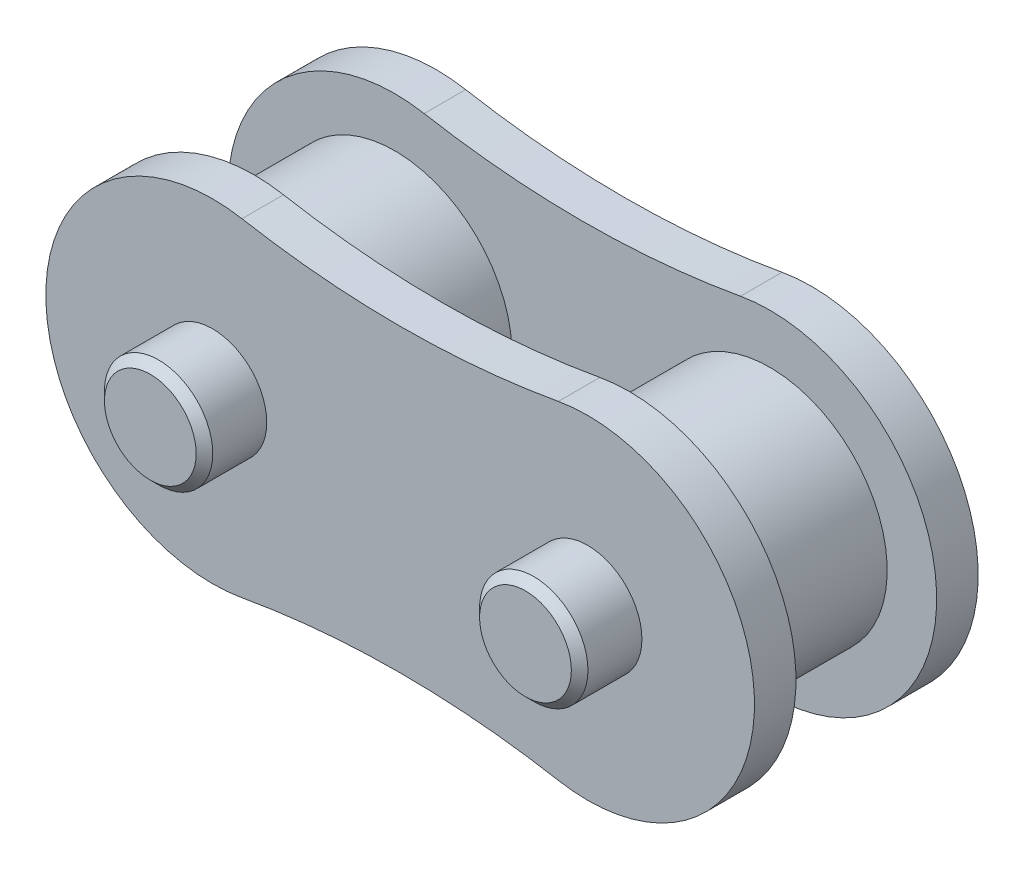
ISO-10303-21;
HEADER;
FILE_DESCRIPTION(('STEP AP214'),'2;1');
FILE_NAME('part.step','',(''),(''),'','','');
FILE_SCHEMA(('AUTOMOTIVE_DESIGN { 1 0 10303 214 1 1 1 1 }'));
ENDSEC;
DATA;
#1=APPLICATION_CONTEXT('core data for automotive mechanical design processes');
#2=APPLICATION_PROTOCOL_DEFINITION('international standard','automotive_design',2000,#1);
#3=PRODUCT_CONTEXT('',#1,'mechanical');
#4=PRODUCT('Part','Part','',(#3));
#5=PRODUCT_RELATED_PRODUCT_CATEGORY('part','',(#4));
#6=PRODUCT_DEFINITION_FORMATION('','',#4);
#7=PRODUCT_DEFINITION_CONTEXT('part definition',#1,'design');
#8=PRODUCT_DEFINITION('design','',#6,#7);
#9=PRODUCT_DEFINITION_SHAPE('','',#8);
#10=(LENGTH_UNIT() NAMED_UNIT(*) SI_UNIT(.MILLI.,.METRE.));
#11=(NAMED_UNIT(*) PLANE_ANGLE_UNIT() SI_UNIT($,.RADIAN.));
#12=(NAMED_UNIT(*) SI_UNIT($,.STERADIAN.) SOLID_ANGLE_UNIT());
#13=UNCERTAINTY_MEASURE_WITH_UNIT(LENGTH_MEASURE(1.E-05),#10,'distance_accuracy_value','');
#14=(GEOMETRIC_REPRESENTATION_CONTEXT(3) GLOBAL_UNCERTAINTY_ASSIGNED_CONTEXT((#13)) GLOBAL_UNIT_ASSIGNED_CONTEXT((#10,
#11,#12)) REPRESENTATION_CONTEXT('',''));
#15=CARTESIAN_POINT('',(0.,0.,0.));
#16=DIRECTION('',(0.,0.,1.));
#17=DIRECTION('',(1.,0.,0.));
#18=AXIS2_PLACEMENT_3D('',#15,#16,#17);
#19=CARTESIAN_POINT('',(-2.,-11.1628830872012,2.385));
#20=DIRECTION('',(0.,0.,1.));
#21=DIRECTION('',(1.,0.,0.));
#22=AXIS2_PLACEMENT_3D('',#19,#20,#21);
#23=PLANE('',#22);
#24=CARTESIAN_POINT('',(4.,0.,2.385));
#25=DIRECTION('',(0.,0.,1.));
#26=DIRECTION('',(1.,0.,0.));
#27=AXIS2_PLACEMENT_3D('',#24,#25,#26);
#28=CIRCLE('',#27,1.155);
#29=CARTESIAN_POINT('',(5.155,0.,2.385));
#30=VERTEX_POINT('',#29);
#31=EDGE_CURVE('E158',#30,#30,#28,.T.);
#32=ORIENTED_EDGE('',*,*,#31,.F.);
#33=EDGE_LOOP('',(#32));
#34=FACE_BOUND('',#33,.T.);
#35=CARTESIAN_POINT('',(0.,-22.3257661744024,2.385));
#36=DIRECTION('',(0.,0.,-1.));
#37=DIRECTION('',(1.,0.,0.));
#38=AXIS2_PLACEMENT_3D('',#35,#36,#37);
#39=CIRCLE('',#38,19.1262661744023);
#40=CARTESIAN_POINT('',(-3.37305087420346,-3.49927989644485,2.385));
#41=VERTEX_POINT('',#40);
#42=CARTESIAN_POINT('',(3.37305087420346,-3.49927989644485,2.385));
#43=VERTEX_POINT('',#42);
#44=EDGE_CURVE('E162',#41,#43,#39,.T.);
#45=ORIENTED_EDGE('',*,*,#44,.T.);
#46=CARTESIAN_POINT('',(4.,0.,2.385));
#47=DIRECTION('',(0.,0.,1.));
#48=DIRECTION('',(1.,0.,0.));
#49=AXIS2_PLACEMENT_3D('',#46,#47,#48);
#50=CIRCLE('',#49,3.55500000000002);
#51=CARTESIAN_POINT('',(3.37305087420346,3.49927989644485,2.385));
#52=VERTEX_POINT('',#51);
#53=EDGE_CURVE('E80',#43,#52,#50,.T.);
#54=ORIENTED_EDGE('',*,*,#53,.T.);
#55=CARTESIAN_POINT('',(0.,22.3257661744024,2.385));
#56=DIRECTION('',(0.,0.,-1.));
#57=DIRECTION('',(1.,0.,0.));
#58=AXIS2_PLACEMENT_3D('',#55,#56,#57);
#59=CIRCLE('',#58,19.1262661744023);
#60=CARTESIAN_POINT('',(-3.37305087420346,3.49927989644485,2.385));
#61=VERTEX_POINT('',#60);
#62=EDGE_CURVE('E165',#52,#61,#59,.T.);
#63=ORIENTED_EDGE('',*,*,#62,.T.);
#64=CARTESIAN_POINT('',(-4.,0.,2.385));
#65=DIRECTION('',(0.,0.,1.));
#66=DIRECTION('',(1.,0.,0.));
#67=AXIS2_PLACEMENT_3D('',#64,#65,#66);
#68=CIRCLE('',#67,3.55500000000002);
#69=EDGE_CURVE('E48',#61,#41,#68,.T.);
#70=ORIENTED_EDGE('',*,*,#69,.T.);
#71=EDGE_LOOP('',(#45,#54,#63,#70));
#72=FACE_BOUND('',#71,.T.);
#73=CARTESIAN_POINT('',(-4.,0.,2.385));
#74=DIRECTION('',(0.,0.,1.));
#75=DIRECTION('',(1.,0.,0.));
#76=AXIS2_PLACEMENT_3D('',#73,#74,#75);
#77=CIRCLE('',#76,1.155);
#78=CARTESIAN_POINT('',(-2.845,0.,2.385));
#79=VERTEX_POINT('',#78);
#80=EDGE_CURVE('E155',#79,#79,#77,.T.);
#81=ORIENTED_EDGE('',*,*,#80,.F.);
#82=EDGE_LOOP('',(#81));
#83=FACE_BOUND('',#82,.T.);
#84=ADVANCED_FACE('F31',(#34,#72,#83),#23,.T.);
#85=CARTESIAN_POINT('',(-2.,-11.1628830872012,1.5));
#86=DIRECTION('',(0.,0.,1.));
#87=DIRECTION('',(1.,0.,0.));
#88=AXIS2_PLACEMENT_3D('',#85,#86,#87);
#89=PLANE('',#88);
#90=CARTESIAN_POINT('',(4.,0.,1.5));
#91=DIRECTION('',(0.,0.,1.));
#92=DIRECTION('',(1.,0.,0.));
#93=AXIS2_PLACEMENT_3D('',#90,#91,#92);
#94=CIRCLE('',#93,2.5);
#95=CARTESIAN_POINT('',(6.5,0.,1.5));
#96=VERTEX_POINT('',#95);
#97=EDGE_CURVE('E182',#96,#96,#94,.T.);
#98=ORIENTED_EDGE('',*,*,#97,.T.);
#99=EDGE_LOOP('',(#98));
#100=FACE_BOUND('',#99,.T.);
#101=CARTESIAN_POINT('',(0.,-22.3257661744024,1.5));
#102=DIRECTION('',(0.,0.,-1.));
#103=DIRECTION('',(1.,0.,0.));
#104=AXIS2_PLACEMENT_3D('',#101,#102,#103);
#105=CIRCLE('',#104,19.1262661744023);
#106=CARTESIAN_POINT('',(-3.37305087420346,-3.49927989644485,1.5));
#107=VERTEX_POINT('',#106);
#108=CARTESIAN_POINT('',(3.37305087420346,-3.49927989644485,1.5));
#109=VERTEX_POINT('',#108);
#110=EDGE_CURVE('E161',#107,#109,#105,.T.);
#111=ORIENTED_EDGE('',*,*,#110,.F.);
#112=CARTESIAN_POINT('',(-4.,0.,1.5));
#113=DIRECTION('',(0.,0.,1.));
#114=DIRECTION('',(1.,0.,0.));
#115=AXIS2_PLACEMENT_3D('',#112,#113,#114);
#116=CIRCLE('',#115,3.55500000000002);
#117=CARTESIAN_POINT('',(-3.37305087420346,3.49927989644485,1.5));
#118=VERTEX_POINT('',#117);
#119=EDGE_CURVE('E72',#118,#107,#116,.T.);
#120=ORIENTED_EDGE('',*,*,#119,.F.);
#121=CARTESIAN_POINT('',(0.,22.3257661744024,1.5));
#122=DIRECTION('',(0.,0.,-1.));
#123=DIRECTION('',(1.,0.,0.));
#124=AXIS2_PLACEMENT_3D('',#121,#122,#123);
#125=CIRCLE('',#124,19.1262661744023);
#126=CARTESIAN_POINT('',(3.37305087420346,3.49927989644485,1.5));
#127=VERTEX_POINT('',#126);
#128=EDGE_CURVE('E66',#127,#118,#125,.T.);
#129=ORIENTED_EDGE('',*,*,#128,.F.);
#130=CARTESIAN_POINT('',(4.,0.,1.5));
#131=DIRECTION('',(0.,0.,1.));
#132=DIRECTION('',(1.,0.,0.));
#133=AXIS2_PLACEMENT_3D('',#130,#131,#132);
#134=CIRCLE('',#133,3.55500000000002);
#135=EDGE_CURVE('E171',#109,#127,#134,.T.);
#136=ORIENTED_EDGE('',*,*,#135,.F.);
#137=EDGE_LOOP('',(#111,#120,#129,#136));
#138=FACE_BOUND('',#137,.T.);
#139=CARTESIAN_POINT('',(-4.,0.,1.5));
#140=DIRECTION('',(0.,0.,1.));
#141=DIRECTION('',(1.,0.,0.));
#142=AXIS2_PLACEMENT_3D('',#139,#140,#141);
#143=CIRCLE('',#142,2.5);
#144=CARTESIAN_POINT('',(-1.5,0.,1.5));
#145=VERTEX_POINT('',#144);
#146=EDGE_CURVE('E185',#145,#145,#143,.F.);
#147=ORIENTED_EDGE('',*,*,#146,.F.);
#148=EDGE_LOOP('',(#147));
#149=FACE_BOUND('',#148,.T.);
#150=ADVANCED_FACE('F227',(#100,#138,#149),#89,.F.);
#151=CARTESIAN_POINT('',(4.,0.,1.5));
#152=DIRECTION('',(0.,0.,-1.));
#153=DIRECTION('',(-1.,0.,0.));
#154=AXIS2_PLACEMENT_3D('',#151,#152,#153);
#155=CYLINDRICAL_SURFACE('',#154,2.5);
#156=ORIENTED_EDGE('',*,*,#97,.F.);
#157=EDGE_LOOP('',(#156));
#158=FACE_BOUND('',#157,.T.);
#159=CARTESIAN_POINT('',(4.,0.,-1.5));
#160=DIRECTION('',(0.,0.,-1.));
#161=DIRECTION('',(-1.,0.,0.));
#162=AXIS2_PLACEMENT_3D('',#159,#160,#161);
#163=CIRCLE('',#162,2.5);
#164=CARTESIAN_POINT('',(1.5,0.,-1.5));
#165=VERTEX_POINT('',#164);
#166=EDGE_CURVE('E152',#165,#165,#163,.T.);
#167=ORIENTED_EDGE('',*,*,#166,.F.);
#168=EDGE_LOOP('',(#167));
#169=FACE_BOUND('',#168,.T.);
#170=ADVANCED_FACE('F233',(#158,#169),#155,.T.);
#171=CARTESIAN_POINT('',(0.,-22.3257661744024,2.385));
#172=DIRECTION('',(0.,0.,-1.));
#173=DIRECTION('',(-1.,0.,0.));
#174=AXIS2_PLACEMENT_3D('',#171,#172,#173);
#175=CYLINDRICAL_SURFACE('',#174,19.1262661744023);
#176=ORIENTED_EDGE('',*,*,#110,.T.);
#177=DIRECTION('',(0.,0.,-1.));
#178=VECTOR('',#177,1.);
#179=CARTESIAN_POINT('',(3.37305087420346,-3.49927989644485,2.385));
#180=LINE('',#179,#178);
#181=EDGE_CURVE('E180',#43,#109,#180,.T.);
#182=ORIENTED_EDGE('',*,*,#181,.F.);
#183=ORIENTED_EDGE('',*,*,#44,.F.);
#184=DIRECTION('',(0.,0.,-1.));
#185=VECTOR('',#184,1.);
#186=CARTESIAN_POINT('',(-3.37305087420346,-3.49927989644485,2.385));
#187=LINE('',#186,#185);
#188=EDGE_CURVE('E168',#41,#107,#187,.T.);
#189=ORIENTED_EDGE('',*,*,#188,.T.);
#190=EDGE_LOOP('',(#176,#182,#183,#189));
#191=FACE_BOUND('',#190,.T.);
#192=ADVANCED_FACE('F250',(#191),#175,.F.);
#193=CARTESIAN_POINT('',(4.,0.,2.385));
#194=DIRECTION('',(0.,0.,-1.));
#195=DIRECTION('',(-1.,0.,0.));
#196=AXIS2_PLACEMENT_3D('',#193,#194,#195);
#197=CYLINDRICAL_SURFACE('',#196,3.55500000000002);
#198=ORIENTED_EDGE('',*,*,#135,.T.);
#199=DIRECTION('',(0.,0.,-1.));
#200=VECTOR('',#199,1.);
#201=CARTESIAN_POINT('',(3.37305087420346,3.49927989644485,2.385));
#202=LINE('',#201,#200);
#203=EDGE_CURVE('E178',#52,#127,#202,.T.);
#204=ORIENTED_EDGE('',*,*,#203,.F.);
#205=ORIENTED_EDGE('',*,*,#53,.F.);
#206=ORIENTED_EDGE('',*,*,#181,.T.);
#207=EDGE_LOOP('',(#198,#204,#205,#206));
#208=FACE_BOUND('',#207,.T.);
#209=ADVANCED_FACE('F247',(#208),#197,.T.);
#210=CARTESIAN_POINT('',(0.,22.3257661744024,2.385));
#211=DIRECTION('',(0.,0.,-1.));
#212=DIRECTION('',(-1.,0.,0.));
#213=AXIS2_PLACEMENT_3D('',#210,#211,#212);
#214=CYLINDRICAL_SURFACE('',#213,19.1262661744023);
#215=ORIENTED_EDGE('',*,*,#128,.T.);
#216=DIRECTION('',(0.,0.,-1.));
#217=VECTOR('',#216,1.);
#218=CARTESIAN_POINT('',(-3.37305087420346,3.49927989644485,2.385));
#219=LINE('',#218,#217);
#220=EDGE_CURVE('E176',#61,#118,#219,.T.);
#221=ORIENTED_EDGE('',*,*,#220,.F.);
#222=ORIENTED_EDGE('',*,*,#62,.F.);
#223=ORIENTED_EDGE('',*,*,#203,.T.);
#224=EDGE_LOOP('',(#215,#221,#222,#223));
#225=FACE_BOUND('',#224,.T.);
#226=ADVANCED_FACE('F244',(#225),#214,.F.);
#227=CARTESIAN_POINT('',(-4.,0.,2.385));
#228=DIRECTION('',(0.,0.,-1.));
#229=DIRECTION('',(-1.,0.,0.));
#230=AXIS2_PLACEMENT_3D('',#227,#228,#229);
#231=CYLINDRICAL_SURFACE('',#230,3.55500000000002);
#232=ORIENTED_EDGE('',*,*,#119,.T.);
#233=ORIENTED_EDGE('',*,*,#188,.F.);
#234=ORIENTED_EDGE('',*,*,#69,.F.);
#235=ORIENTED_EDGE('',*,*,#220,.T.);
#236=EDGE_LOOP('',(#232,#233,#234,#235));
#237=FACE_BOUND('',#236,.T.);
#238=ADVANCED_FACE('F241',(#237),#231,.T.);
#239=CARTESIAN_POINT('',(-4.,0.,1.5));
#240=DIRECTION('',(0.,0.,-1.));
#241=DIRECTION('',(-1.,0.,0.));
#242=AXIS2_PLACEMENT_3D('',#239,#240,#241);
#243=CYLINDRICAL_SURFACE('',#242,2.5);
#244=ORIENTED_EDGE('',*,*,#146,.T.);
#245=EDGE_LOOP('',(#244));
#246=FACE_BOUND('',#245,.T.);
#247=CARTESIAN_POINT('',(-4.,0.,-1.5));
#248=DIRECTION('',(0.,0.,-1.));
#249=DIRECTION('',(-1.,0.,0.));
#250=AXIS2_PLACEMENT_3D('',#247,#248,#249);
#251=CIRCLE('',#250,2.5);
#252=CARTESIAN_POINT('',(-6.5,0.,-1.5));
#253=VERTEX_POINT('',#252);
#254=EDGE_CURVE('E118',#253,#253,#251,.T.);
#255=ORIENTED_EDGE('',*,*,#254,.F.);
#256=EDGE_LOOP('',(#255));
#257=FACE_BOUND('',#256,.T.);
#258=ADVANCED_FACE('F238',(#246,#257),#243,.T.);
#259=CARTESIAN_POINT('',(4.,0.,3.7125));
#260=DIRECTION('',(0.,0.,-1.));
#261=DIRECTION('',(-1.,0.,0.));
#262=AXIS2_PLACEMENT_3D('',#259,#260,#261);
#263=CYLINDRICAL_SURFACE('',#262,1.155);
#264=CARTESIAN_POINT('',(4.,0.,3.5355));
#265=DIRECTION('',(0.,0.,1.));
#266=DIRECTION('',(1.,0.,0.));
#267=AXIS2_PLACEMENT_3D('',#264,#265,#266);
#268=CIRCLE('',#267,1.155);
#269=CARTESIAN_POINT('',(5.155,0.,3.5355));
#270=VERTEX_POINT('',#269);
#271=EDGE_CURVE('E191',#270,#270,#268,.F.);
#272=ORIENTED_EDGE('',*,*,#271,.T.);
#273=EDGE_LOOP('',(#272));
#274=FACE_BOUND('',#273,.T.);
#275=ORIENTED_EDGE('',*,*,#31,.T.);
#276=EDGE_LOOP('',(#275));
#277=FACE_BOUND('',#276,.T.);
#278=ADVANCED_FACE('F288',(#274,#277),#263,.T.);
#279=CARTESIAN_POINT('',(4.,0.,3.7125));
#280=DIRECTION('',(0.,0.,1.));
#281=DIRECTION('',(1.,0.,0.));
#282=AXIS2_PLACEMENT_3D('',#279,#280,#281);
#283=PLANE('',#282);
#284=CARTESIAN_POINT('',(4.,0.,3.7125));
#285=DIRECTION('',(0.,0.,1.));
#286=DIRECTION('',(1.,0.,0.));
#287=AXIS2_PLACEMENT_3D('',#284,#285,#286);
#288=CIRCLE('',#287,0.977999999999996);
#289=CARTESIAN_POINT('',(4.978,0.,3.7125));
#290=VERTEX_POINT('',#289);
#291=EDGE_CURVE('E188',#290,#290,#288,.T.);
#292=ORIENTED_EDGE('',*,*,#291,.T.);
#293=EDGE_LOOP('',(#292));
#294=FACE_BOUND('',#293,.T.);
#295=ADVANCED_FACE('F281',(#294),#283,.T.);
#296=CARTESIAN_POINT('',(-4.,0.,3.7125));
#297=DIRECTION('',(0.,0.,-1.));
#298=DIRECTION('',(-1.,0.,0.));
#299=AXIS2_PLACEMENT_3D('',#296,#297,#298);
#300=CYLINDRICAL_SURFACE('',#299,1.155);
#301=CARTESIAN_POINT('',(-4.,0.,3.5355));
#302=DIRECTION('',(0.,0.,1.));
#303=DIRECTION('',(1.,0.,0.));
#304=AXIS2_PLACEMENT_3D('',#301,#302,#303);
#305=CIRCLE('',#304,1.155);
#306=CARTESIAN_POINT('',(-2.845,0.,3.5355));
#307=VERTEX_POINT('',#306);
#308=EDGE_CURVE('E197',#307,#307,#305,.F.);
#309=ORIENTED_EDGE('',*,*,#308,.T.);
#310=EDGE_LOOP('',(#309));
#311=FACE_BOUND('',#310,.T.);
#312=ORIENTED_EDGE('',*,*,#80,.T.);
#313=EDGE_LOOP('',(#312));
#314=FACE_BOUND('',#313,.T.);
#315=ADVANCED_FACE('F276',(#311,#314),#300,.T.);
#316=CARTESIAN_POINT('',(-4.,0.,3.7125));
#317=DIRECTION('',(0.,0.,1.));
#318=DIRECTION('',(1.,0.,0.));
#319=AXIS2_PLACEMENT_3D('',#316,#317,#318);
#320=PLANE('',#319);
#321=CARTESIAN_POINT('',(-4.,0.,3.7125));
#322=DIRECTION('',(0.,0.,1.));
#323=DIRECTION('',(1.,0.,0.));
#324=AXIS2_PLACEMENT_3D('',#321,#322,#323);
#325=CIRCLE('',#324,0.978000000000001);
#326=CARTESIAN_POINT('',(-3.022,0.,3.7125));
#327=VERTEX_POINT('',#326);
#328=EDGE_CURVE('E194',#327,#327,#325,.T.);
#329=ORIENTED_EDGE('',*,*,#328,.T.);
#330=EDGE_LOOP('',(#329));
#331=FACE_BOUND('',#330,.T.);
#332=ADVANCED_FACE('F261',(#331),#320,.T.);
#333=CARTESIAN_POINT('',(4.,0.,3.7125));
#334=DIRECTION('',(0.,0.,-1.));
#335=DIRECTION('',(-1.,0.,0.));
#336=AXIS2_PLACEMENT_3D('',#333,#334,#335);
#337=CONICAL_SURFACE('',#336,0.977999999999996,0.785398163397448);
#338=ORIENTED_EDGE('',*,*,#271,.F.);
#339=EDGE_LOOP('',(#338));
#340=FACE_BOUND('',#339,.T.);
#341=ORIENTED_EDGE('',*,*,#291,.F.);
#342=EDGE_LOOP('',(#341));
#343=FACE_BOUND('',#342,.T.);
#344=ADVANCED_FACE('F257',(#340,#343),#337,.T.);
#345=CARTESIAN_POINT('',(-4.,0.,3.7125));
#346=DIRECTION('',(0.,0.,-1.));
#347=DIRECTION('',(-1.,0.,0.));
#348=AXIS2_PLACEMENT_3D('',#345,#346,#347);
#349=CONICAL_SURFACE('',#348,0.978000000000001,0.785398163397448);
#350=ORIENTED_EDGE('',*,*,#308,.F.);
#351=EDGE_LOOP('',(#350));
#352=FACE_BOUND('',#351,.T.);
#353=ORIENTED_EDGE('',*,*,#328,.F.);
#354=EDGE_LOOP('',(#353));
#355=FACE_BOUND('',#354,.T.);
#356=ADVANCED_FACE('F260',(#352,#355),#349,.T.);
#357=CARTESIAN_POINT('',(-2.,-11.1628830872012,-1.5));
#358=DIRECTION('',(0.,0.,-1.));
#359=DIRECTION('',(1.,0.,0.));
#360=AXIS2_PLACEMENT_3D('',#357,#358,#359);
#361=PLANE('',#360);
#362=ORIENTED_EDGE('',*,*,#254,.T.);
#363=EDGE_LOOP('',(#362));
#364=FACE_BOUND('',#363,.T.);
#365=CARTESIAN_POINT('',(0.,-22.3257661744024,-1.5));
#366=DIRECTION('',(0.,0.,-1.));
#367=DIRECTION('',(1.,0.,0.));
#368=AXIS2_PLACEMENT_3D('',#365,#366,#367);
#369=CIRCLE('',#368,19.1262661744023);
#370=CARTESIAN_POINT('',(-3.37305087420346,-3.49927989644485,-1.5));
#371=VERTEX_POINT('',#370);
#372=CARTESIAN_POINT('',(3.37305087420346,-3.49927989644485,-1.5));
#373=VERTEX_POINT('',#372);
#374=EDGE_CURVE('E113',#371,#373,#369,.T.);
#375=ORIENTED_EDGE('',*,*,#374,.T.);
#376=CARTESIAN_POINT('',(4.,0.,-1.5));
#377=DIRECTION('',(0.,0.,1.));
#378=DIRECTION('',(1.,0.,0.));
#379=AXIS2_PLACEMENT_3D('',#376,#377,#378);
#380=CIRCLE('',#379,3.55500000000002);
#381=CARTESIAN_POINT('',(3.37305087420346,3.49927989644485,-1.5));
#382=VERTEX_POINT('',#381);
#383=EDGE_CURVE('E129',#373,#382,#380,.T.);
#384=ORIENTED_EDGE('',*,*,#383,.T.);
#385=CARTESIAN_POINT('',(0.,22.3257661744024,-1.5));
#386=DIRECTION('',(0.,0.,-1.));
#387=DIRECTION('',(1.,0.,0.));
#388=AXIS2_PLACEMENT_3D('',#385,#386,#387);
#389=CIRCLE('',#388,19.1262661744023);
#390=CARTESIAN_POINT('',(-3.37305087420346,3.49927989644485,-1.5));
#391=VERTEX_POINT('',#390);
#392=EDGE_CURVE('E141',#382,#391,#389,.T.);
#393=ORIENTED_EDGE('',*,*,#392,.T.);
#394=CARTESIAN_POINT('',(-4.,0.,-1.5));
#395=DIRECTION('',(0.,0.,1.));
#396=DIRECTION('',(1.,0.,0.));
#397=AXIS2_PLACEMENT_3D('',#394,#395,#396);
#398=CIRCLE('',#397,3.55500000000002);
#399=EDGE_CURVE('E139',#391,#371,#398,.T.);
#400=ORIENTED_EDGE('',*,*,#399,.T.);
#401=EDGE_LOOP('',(#375,#384,#393,#400));
#402=FACE_BOUND('',#401,.T.);
#403=ORIENTED_EDGE('',*,*,#166,.T.);
#404=EDGE_LOOP('',(#403));
#405=FACE_BOUND('',#404,.T.);
#406=ADVANCED_FACE('F264',(#364,#402,#405),#361,.F.);
#407=CARTESIAN_POINT('',(0.,-22.3257661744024,-2.385));
#408=DIRECTION('',(0.,0.,1.));
#409=DIRECTION('',(1.,0.,0.));
#410=AXIS2_PLACEMENT_3D('',#407,#408,#409);
#411=CYLINDRICAL_SURFACE('',#410,19.1262661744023);
#412=ORIENTED_EDGE('',*,*,#374,.F.);
#413=DIRECTION('',(0.,0.,1.));
#414=VECTOR('',#413,1.);
#415=CARTESIAN_POINT('',(-3.37305087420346,-3.49927989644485,-2.385));
#416=LINE('',#415,#414);
#417=CARTESIAN_POINT('',(-3.37305087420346,-3.49927989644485,-2.385));
#418=VERTEX_POINT('',#417);
#419=EDGE_CURVE('E107',#418,#371,#416,.T.);
#420=ORIENTED_EDGE('',*,*,#419,.F.);
#421=CARTESIAN_POINT('',(0.,-22.3257661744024,-2.385));
#422=DIRECTION('',(0.,0.,-1.));
#423=DIRECTION('',(1.,0.,0.));
#424=AXIS2_PLACEMENT_3D('',#421,#422,#423);
#425=CIRCLE('',#424,19.1262661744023);
#426=CARTESIAN_POINT('',(3.37305087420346,-3.49927989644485,-2.385));
#427=VERTEX_POINT('',#426);
#428=EDGE_CURVE('E110',#418,#427,#425,.T.);
#429=ORIENTED_EDGE('',*,*,#428,.T.);
#430=DIRECTION('',(0.,0.,1.));
#431=VECTOR('',#430,1.);
#432=CARTESIAN_POINT('',(3.37305087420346,-3.49927989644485,-2.385));
#433=LINE('',#432,#431);
#434=EDGE_CURVE('E137',#427,#373,#433,.T.);
#435=ORIENTED_EDGE('',*,*,#434,.T.);
#436=EDGE_LOOP('',(#412,#420,#429,#435));
#437=FACE_BOUND('',#436,.T.);
#438=ADVANCED_FACE('F109',(#437),#411,.F.);
#439=CARTESIAN_POINT('',(-4.,0.,-2.385));
#440=DIRECTION('',(0.,0.,1.));
#441=DIRECTION('',(1.,0.,0.));
#442=AXIS2_PLACEMENT_3D('',#439,#440,#441);
#443=CYLINDRICAL_SURFACE('',#442,3.55500000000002);
#444=ORIENTED_EDGE('',*,*,#399,.F.);
#445=DIRECTION('',(0.,0.,1.));
#446=VECTOR('',#445,1.);
#447=CARTESIAN_POINT('',(-3.37305087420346,3.49927989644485,-2.385));
#448=LINE('',#447,#446);
#449=CARTESIAN_POINT('',(-3.37305087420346,3.49927989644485,-2.385));
#450=VERTEX_POINT('',#449);
#451=EDGE_CURVE('E119',#450,#391,#448,.T.);
#452=ORIENTED_EDGE('',*,*,#451,.F.);
#453=CARTESIAN_POINT('',(-4.,0.,-2.385));
#454=DIRECTION('',(0.,0.,1.));
#455=DIRECTION('',(1.,0.,0.));
#456=AXIS2_PLACEMENT_3D('',#453,#454,#455);
#457=CIRCLE('',#456,3.55500000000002);
#458=EDGE_CURVE('E125',#450,#418,#457,.T.);
#459=ORIENTED_EDGE('',*,*,#458,.T.);
#460=ORIENTED_EDGE('',*,*,#419,.T.);
#461=EDGE_LOOP('',(#444,#452,#459,#460));
#462=FACE_BOUND('',#461,.T.);
#463=ADVANCED_FACE('F131',(#462),#443,.T.);
#464=CARTESIAN_POINT('',(0.,22.3257661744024,-2.385));
#465=DIRECTION('',(0.,0.,1.));
#466=DIRECTION('',(1.,0.,0.));
#467=AXIS2_PLACEMENT_3D('',#464,#465,#466);
#468=CYLINDRICAL_SURFACE('',#467,19.1262661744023);
#469=ORIENTED_EDGE('',*,*,#392,.F.);
#470=DIRECTION('',(0.,0.,1.));
#471=VECTOR('',#470,1.);
#472=CARTESIAN_POINT('',(3.37305087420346,3.49927989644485,-2.385));
#473=LINE('',#472,#471);
#474=CARTESIAN_POINT('',(3.37305087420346,3.49927989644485,-2.385));
#475=VERTEX_POINT('',#474);
#476=EDGE_CURVE('E147',#475,#382,#473,.T.);
#477=ORIENTED_EDGE('',*,*,#476,.F.);
#478=CARTESIAN_POINT('',(0.,22.3257661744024,-2.385));
#479=DIRECTION('',(0.,0.,-1.));
#480=DIRECTION('',(1.,0.,0.));
#481=AXIS2_PLACEMENT_3D('',#478,#479,#480);
#482=CIRCLE('',#481,19.1262661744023);
#483=EDGE_CURVE('E132',#475,#450,#482,.T.);
#484=ORIENTED_EDGE('',*,*,#483,.T.);
#485=ORIENTED_EDGE('',*,*,#451,.T.);
#486=EDGE_LOOP('',(#469,#477,#484,#485));
#487=FACE_BOUND('',#486,.T.);
#488=ADVANCED_FACE('F314',(#487),#468,.F.);
#489=CARTESIAN_POINT('',(4.,0.,-2.385));
#490=DIRECTION('',(0.,0.,1.));
#491=DIRECTION('',(1.,0.,0.));
#492=AXIS2_PLACEMENT_3D('',#489,#490,#491);
#493=CYLINDRICAL_SURFACE('',#492,3.55500000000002);
#494=ORIENTED_EDGE('',*,*,#383,.F.);
#495=ORIENTED_EDGE('',*,*,#434,.F.);
#496=CARTESIAN_POINT('',(4.,0.,-2.385));
#497=DIRECTION('',(0.,0.,1.));
#498=DIRECTION('',(1.,0.,0.));
#499=AXIS2_PLACEMENT_3D('',#496,#497,#498);
#500=CIRCLE('',#499,3.55500000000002);
#501=EDGE_CURVE('E128',#427,#475,#500,.T.);
#502=ORIENTED_EDGE('',*,*,#501,.T.);
#503=ORIENTED_EDGE('',*,*,#476,.T.);
#504=EDGE_LOOP('',(#494,#495,#502,#503));
#505=FACE_BOUND('',#504,.T.);
#506=ADVANCED_FACE('F311',(#505),#493,.T.);
#507=CARTESIAN_POINT('',(-2.,-11.1628830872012,-2.385));
#508=DIRECTION('',(0.,0.,-1.));
#509=DIRECTION('',(1.,0.,0.));
#510=AXIS2_PLACEMENT_3D('',#507,#508,#509);
#511=PLANE('',#510);
#512=CARTESIAN_POINT('',(-4.,0.,-2.385));
#513=DIRECTION('',(0.,0.,-1.));
#514=DIRECTION('',(-1.,0.,0.));
#515=AXIS2_PLACEMENT_3D('',#512,#513,#514);
#516=CIRCLE('',#515,1.155);
#517=CARTESIAN_POINT('',(-5.155,0.,-2.385));
#518=VERTEX_POINT('',#517);
#519=EDGE_CURVE('E203',#518,#518,#516,.T.);
#520=ORIENTED_EDGE('',*,*,#519,.F.);
#521=EDGE_LOOP('',(#520));
#522=FACE_BOUND('',#521,.T.);
#523=CARTESIAN_POINT('',(4.,0.,-2.385));
#524=DIRECTION('',(0.,0.,-1.));
#525=DIRECTION('',(-1.,0.,0.));
#526=AXIS2_PLACEMENT_3D('',#523,#524,#525);
#527=CIRCLE('',#526,1.155);
#528=CARTESIAN_POINT('',(2.845,0.,-2.385));
#529=VERTEX_POINT('',#528);
#530=EDGE_CURVE('E200',#529,#529,#527,.T.);
#531=ORIENTED_EDGE('',*,*,#530,.F.);
#532=EDGE_LOOP('',(#531));
#533=FACE_BOUND('',#532,.T.);
#534=ORIENTED_EDGE('',*,*,#428,.F.);
#535=ORIENTED_EDGE('',*,*,#458,.F.);
#536=ORIENTED_EDGE('',*,*,#483,.F.);
#537=ORIENTED_EDGE('',*,*,#501,.F.);
#538=EDGE_LOOP('',(#534,#535,#536,#537));
#539=FACE_BOUND('',#538,.T.);
#540=ADVANCED_FACE('F123',(#522,#533,#539),#511,.T.);
#541=CARTESIAN_POINT('',(4.,0.,-3.7125));
#542=DIRECTION('',(0.,0.,1.));
#543=DIRECTION('',(1.,0.,0.));
#544=AXIS2_PLACEMENT_3D('',#541,#542,#543);
#545=CYLINDRICAL_SURFACE('',#544,1.155);
#546=CARTESIAN_POINT('',(4.,0.,-3.5355));
#547=DIRECTION('',(0.,0.,-1.));
#548=DIRECTION('',(-1.,0.,0.));
#549=AXIS2_PLACEMENT_3D('',#546,#547,#548);
#550=CIRCLE('',#549,1.155);
#551=CARTESIAN_POINT('',(2.845,0.,-3.5355));
#552=VERTEX_POINT('',#551);
#553=EDGE_CURVE('E206',#552,#552,#550,.F.);
#554=ORIENTED_EDGE('',*,*,#553,.T.);
#555=EDGE_LOOP('',(#554));
#556=FACE_BOUND('',#555,.T.);
#557=ORIENTED_EDGE('',*,*,#530,.T.);
#558=EDGE_LOOP('',(#557));
#559=FACE_BOUND('',#558,.T.);
#560=ADVANCED_FACE('F325',(#556,#559),#545,.T.);
#561=CARTESIAN_POINT('',(4.,0.,-3.7125));
#562=DIRECTION('',(0.,0.,-1.));
#563=DIRECTION('',(1.,0.,0.));
#564=AXIS2_PLACEMENT_3D('',#561,#562,#563);
#565=PLANE('',#564);
#566=CARTESIAN_POINT('',(4.,0.,-3.7125));
#567=DIRECTION('',(0.,0.,-1.));
#568=DIRECTION('',(-1.,0.,0.));
#569=AXIS2_PLACEMENT_3D('',#566,#567,#568);
#570=CIRCLE('',#569,0.977999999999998);
#571=CARTESIAN_POINT('',(3.022,0.,-3.7125));
#572=VERTEX_POINT('',#571);
#573=EDGE_CURVE('E209',#572,#572,#570,.T.);
#574=ORIENTED_EDGE('',*,*,#573,.T.);
#575=EDGE_LOOP('',(#574));
#576=FACE_BOUND('',#575,.T.);
#577=ADVANCED_FACE('F329',(#576),#565,.T.);
#578=CARTESIAN_POINT('',(-4.,0.,-3.7125));
#579=DIRECTION('',(0.,0.,1.));
#580=DIRECTION('',(1.,0.,0.));
#581=AXIS2_PLACEMENT_3D('',#578,#579,#580);
#582=CYLINDRICAL_SURFACE('',#581,1.155);
#583=CARTESIAN_POINT('',(-4.,0.,-3.5355));
#584=DIRECTION('',(0.,0.,-1.));
#585=DIRECTION('',(-1.,0.,0.));
#586=AXIS2_PLACEMENT_3D('',#583,#584,#585);
#587=CIRCLE('',#586,1.155);
#588=CARTESIAN_POINT('',(-5.155,0.,-3.5355));
#589=VERTEX_POINT('',#588);
#590=EDGE_CURVE('E40',#589,#589,#587,.F.);
#591=ORIENTED_EDGE('',*,*,#590,.T.);
#592=EDGE_LOOP('',(#591));
#593=FACE_BOUND('',#592,.T.);
#594=ORIENTED_EDGE('',*,*,#519,.T.);
#595=EDGE_LOOP('',(#594));
#596=FACE_BOUND('',#595,.T.);
#597=ADVANCED_FACE('F214',(#593,#596),#582,.T.);
#598=CARTESIAN_POINT('',(-4.,0.,-3.7125));
#599=DIRECTION('',(0.,0.,-1.));
#600=DIRECTION('',(1.,0.,0.));
#601=AXIS2_PLACEMENT_3D('',#598,#599,#600);
#602=PLANE('',#601);
#603=CARTESIAN_POINT('',(-4.,0.,-3.7125));
#604=DIRECTION('',(0.,0.,-1.));
#605=DIRECTION('',(-1.,0.,0.));
#606=AXIS2_PLACEMENT_3D('',#603,#604,#605);
#607=CIRCLE('',#606,0.977999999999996);
#608=CARTESIAN_POINT('',(-4.978,0.,-3.7125));
#609=VERTEX_POINT('',#608);
#610=EDGE_CURVE('E11',#609,#609,#607,.T.);
#611=ORIENTED_EDGE('',*,*,#610,.T.);
#612=EDGE_LOOP('',(#611));
#613=FACE_BOUND('',#612,.T.);
#614=ADVANCED_FACE('F223',(#613),#602,.T.);
#615=CARTESIAN_POINT('',(4.,0.,-3.5355));
#616=DIRECTION('',(0.,0.,1.));
#617=DIRECTION('',(1.,0.,0.));
#618=AXIS2_PLACEMENT_3D('',#615,#616,#617);
#619=CONICAL_SURFACE('',#618,1.155,0.785398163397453);
#620=ORIENTED_EDGE('',*,*,#573,.F.);
#621=EDGE_LOOP('',(#620));
#622=FACE_BOUND('',#621,.T.);
#623=ORIENTED_EDGE('',*,*,#553,.F.);
#624=EDGE_LOOP('',(#623));
#625=FACE_BOUND('',#624,.T.);
#626=ADVANCED_FACE('F218',(#622,#625),#619,.T.);
#627=CARTESIAN_POINT('',(-4.,0.,-3.5355));
#628=DIRECTION('',(0.,0.,1.));
#629=DIRECTION('',(1.,0.,0.));
#630=AXIS2_PLACEMENT_3D('',#627,#628,#629);
#631=CONICAL_SURFACE('',#630,1.155,0.785398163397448);
#632=ORIENTED_EDGE('',*,*,#610,.F.);
#633=EDGE_LOOP('',(#632));
#634=FACE_BOUND('',#633,.T.);
#635=ORIENTED_EDGE('',*,*,#590,.F.);
#636=EDGE_LOOP('',(#635));
#637=FACE_BOUND('',#636,.T.);
#638=ADVANCED_FACE('F33',(#634,#637),#631,.T.);
#639=CLOSED_SHELL('',(#84,#150,#170,#192,#209,#226,#238,#258,#278,#295,#315,#332,#344,#356,#406,
#438,#463,#488,#506,#540,#560,#577,#597,#614,#626,#638));
#640=MANIFOLD_SOLID_BREP('B2',#639);
#641=ADVANCED_BREP_SHAPE_REPRESENTATION('',(#18,#640),#14);
#642=SHAPE_DEFINITION_REPRESENTATION(#9,#641);
ENDSEC;
END-ISO-10303-21;
